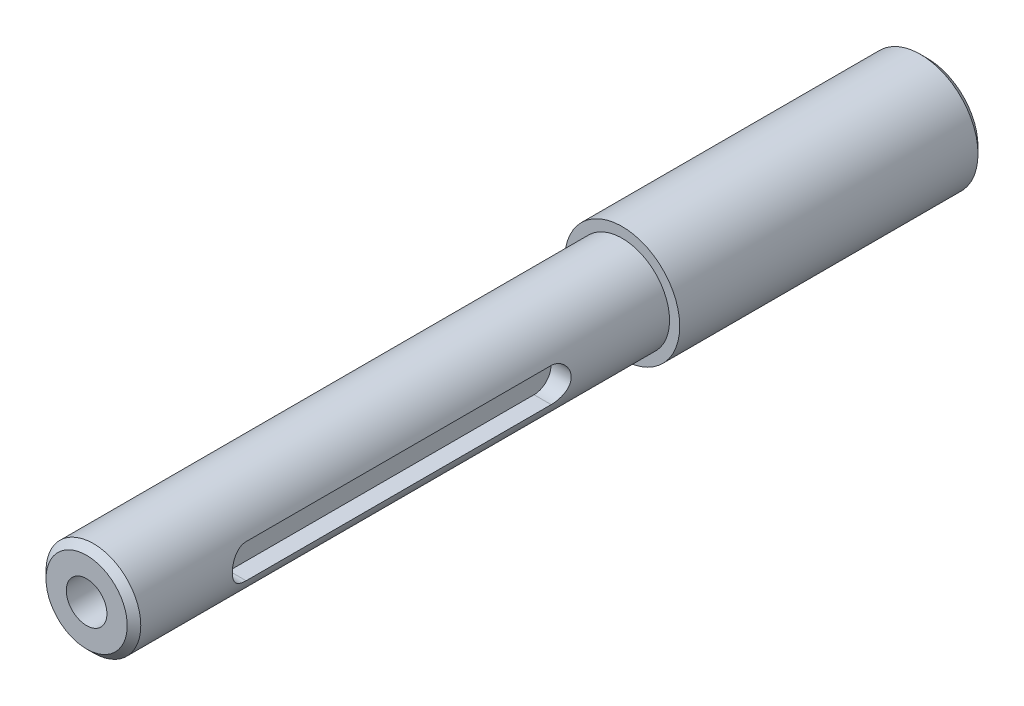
ISO-10303-21;
HEADER;
FILE_DESCRIPTION(('STEP AP214'),'2;1');
FILE_NAME('part.step','',(''),(''),'','','');
FILE_SCHEMA(('AUTOMOTIVE_DESIGN { 1 0 10303 214 1 1 1 1 }'));
ENDSEC;
DATA;
#1=APPLICATION_CONTEXT('core data for automotive mechanical design processes');
#2=APPLICATION_PROTOCOL_DEFINITION('international standard','automotive_design',2000,#1);
#3=PRODUCT_CONTEXT('',#1,'mechanical');
#4=PRODUCT('Part','Part','',(#3));
#5=PRODUCT_RELATED_PRODUCT_CATEGORY('part','',(#4));
#6=PRODUCT_DEFINITION_FORMATION('','',#4);
#7=PRODUCT_DEFINITION_CONTEXT('part definition',#1,'design');
#8=PRODUCT_DEFINITION('design','',#6,#7);
#9=PRODUCT_DEFINITION_SHAPE('','',#8);
#10=(LENGTH_UNIT() NAMED_UNIT(*) SI_UNIT(.MILLI.,.METRE.));
#11=(NAMED_UNIT(*) PLANE_ANGLE_UNIT() SI_UNIT($,.RADIAN.));
#12=(NAMED_UNIT(*) SI_UNIT($,.STERADIAN.) SOLID_ANGLE_UNIT());
#13=UNCERTAINTY_MEASURE_WITH_UNIT(LENGTH_MEASURE(1.E-05),#10,'distance_accuracy_value','');
#14=(GEOMETRIC_REPRESENTATION_CONTEXT(3) GLOBAL_UNCERTAINTY_ASSIGNED_CONTEXT((#13)) GLOBAL_UNIT_ASSIGNED_CONTEXT((#10,
#11,#12)) REPRESENTATION_CONTEXT('',''));
#15=CARTESIAN_POINT('',(0.,0.,0.));
#16=DIRECTION('',(0.,0.,1.));
#17=DIRECTION('',(1.,0.,0.));
#18=AXIS2_PLACEMENT_3D('',#15,#16,#17);
#19=CARTESIAN_POINT('',(0.,0.,0.));
#20=DIRECTION('',(0.,0.,-1.));
#21=DIRECTION('',(-1.,0.,0.));
#22=AXIS2_PLACEMENT_3D('',#19,#20,#21);
#23=PLANE('',#22);
#24=CARTESIAN_POINT('',(0.,0.,-4.48725258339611E-10));
#25=DIRECTION('',(0.,0.,1.));
#26=DIRECTION('',(1.,0.,0.));
#27=AXIS2_PLACEMENT_3D('',#24,#25,#26);
#28=CIRCLE('',#27,7.49000000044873);
#29=CARTESIAN_POINT('',(7.49000000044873,0.,-4.48725258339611E-10));
#30=VERTEX_POINT('',#29);
#31=EDGE_CURVE('E20',#30,#30,#28,.T.);
#32=ORIENTED_EDGE('',*,*,#31,.F.);
#33=EDGE_LOOP('',(#32));
#34=FACE_BOUND('',#33,.T.);
#35=ADVANCED_FACE('F16',(#34),#23,.T.);
#36=CARTESIAN_POINT('',(0.,0.,99.));
#37=DIRECTION('',(0.,0.,1.));
#38=DIRECTION('',(1.,0.,0.));
#39=AXIS2_PLACEMENT_3D('',#36,#37,#38);
#40=CONICAL_SURFACE('',#39,3.,1.02974425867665);
#41=CARTESIAN_POINT('',(0.,0.,97.1974181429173));
#42=VERTEX_POINT('',#41);
#43=VERTEX_LOOP('',#42);
#44=FACE_BOUND('',#43,.T.);
#45=CARTESIAN_POINT('',(0.,0.,99.));
#46=DIRECTION('',(0.,0.,1.));
#47=DIRECTION('',(1.,0.,0.));
#48=AXIS2_PLACEMENT_3D('',#45,#46,#47);
#49=CIRCLE('',#48,3.);
#50=CARTESIAN_POINT('',(3.,0.,99.));
#51=VERTEX_POINT('',#50);
#52=EDGE_CURVE('E69',#51,#51,#49,.T.);
#53=ORIENTED_EDGE('',*,*,#52,.T.);
#54=EDGE_LOOP('',(#53));
#55=FACE_BOUND('',#54,.T.);
#56=ADVANCED_FACE('F63',(#44,#55),#40,.F.);
#57=CARTESIAN_POINT('',(0.,0.,1.00000000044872));
#58=DIRECTION('',(0.,0.,1.));
#59=DIRECTION('',(1.,0.,0.));
#60=AXIS2_PLACEMENT_3D('',#57,#58,#59);
#61=CONICAL_SURFACE('',#60,8.48999999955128,0.785398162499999);
#62=ORIENTED_EDGE('',*,*,#31,.T.);
#63=EDGE_LOOP('',(#62));
#64=FACE_BOUND('',#63,.T.);
#65=CARTESIAN_POINT('',(0.,0.,1.));
#66=DIRECTION('',(0.,0.,1.));
#67=DIRECTION('',(1.,0.,0.));
#68=AXIS2_PLACEMENT_3D('',#65,#66,#67);
#69=CIRCLE('',#68,8.49);
#70=CARTESIAN_POINT('',(8.49,0.,1.));
#71=VERTEX_POINT('',#70);
#72=EDGE_CURVE('E71',#71,#71,#69,.T.);
#73=ORIENTED_EDGE('',*,*,#72,.F.);
#74=EDGE_LOOP('',(#73));
#75=FACE_BOUND('',#74,.T.);
#76=ADVANCED_FACE('F66',(#64,#75),#61,.T.);
#77=CARTESIAN_POINT('',(0.,0.,124.));
#78=DIRECTION('',(0.,0.,-1.));
#79=DIRECTION('',(-1.,0.,0.));
#80=AXIS2_PLACEMENT_3D('',#77,#78,#79);
#81=CYLINDRICAL_SURFACE('',#80,3.);
#82=ORIENTED_EDGE('',*,*,#52,.F.);
#83=EDGE_LOOP('',(#82));
#84=FACE_BOUND('',#83,.T.);
#85=CARTESIAN_POINT('',(0.,0.,124.));
#86=DIRECTION('',(0.,0.,-1.));
#87=DIRECTION('',(-1.,0.,0.));
#88=AXIS2_PLACEMENT_3D('',#85,#86,#87);
#89=CIRCLE('',#88,3.);
#90=CARTESIAN_POINT('',(-3.,0.,124.));
#91=VERTEX_POINT('',#90);
#92=EDGE_CURVE('E74',#91,#91,#89,.F.);
#93=ORIENTED_EDGE('',*,*,#92,.T.);
#94=EDGE_LOOP('',(#93));
#95=FACE_BOUND('',#94,.T.);
#96=ADVANCED_FACE('F18',(#84,#95),#81,.F.);
#97=CARTESIAN_POINT('',(0.,0.,0.));
#98=DIRECTION('',(0.,0.,1.));
#99=DIRECTION('',(1.,0.,0.));
#100=AXIS2_PLACEMENT_3D('',#97,#98,#99);
#101=CYLINDRICAL_SURFACE('',#100,8.49);
#102=ORIENTED_EDGE('',*,*,#72,.T.);
#103=EDGE_LOOP('',(#102));
#104=FACE_BOUND('',#103,.T.);
#105=CARTESIAN_POINT('',(0.,0.,45.));
#106=DIRECTION('',(0.,0.,1.));
#107=DIRECTION('',(1.,0.,0.));
#108=AXIS2_PLACEMENT_3D('',#105,#106,#107);
#109=CIRCLE('',#108,8.49);
#110=CARTESIAN_POINT('',(8.49,0.,45.));
#111=VERTEX_POINT('',#110);
#112=EDGE_CURVE('E132',#111,#111,#109,.F.);
#113=ORIENTED_EDGE('',*,*,#112,.T.);
#114=EDGE_LOOP('',(#113));
#115=FACE_BOUND('',#114,.T.);
#116=ADVANCED_FACE('F150',(#104,#115),#101,.T.);
#117=CARTESIAN_POINT('',(4.,0.,84.5));
#118=DIRECTION('',(1.,0.,0.));
#119=DIRECTION('',(0.,0.,-1.));
#120=AXIS2_PLACEMENT_3D('',#117,#118,#119);
#121=PLANE('',#120);
#122=CARTESIAN_POINT('',(4.,0.,62.));
#123=DIRECTION('',(1.,0.,0.));
#124=DIRECTION('',(0.,0.,-1.));
#125=AXIS2_PLACEMENT_3D('',#122,#123,#124);
#126=CIRCLE('',#125,2.5);
#127=CARTESIAN_POINT('',(4.,-2.5,62.));
#128=VERTEX_POINT('',#127);
#129=CARTESIAN_POINT('',(4.,2.5,62.));
#130=VERTEX_POINT('',#129);
#131=EDGE_CURVE('E59',#128,#130,#126,.T.);
#132=ORIENTED_EDGE('',*,*,#131,.T.);
#133=DIRECTION('',(0.,0.,1.));
#134=VECTOR('',#133,1.);
#135=CARTESIAN_POINT('',(4.,2.5,107.));
#136=LINE('',#135,#134);
#137=CARTESIAN_POINT('',(4.,2.5,107.));
#138=VERTEX_POINT('',#137);
#139=EDGE_CURVE('E131',#130,#138,#136,.T.);
#140=ORIENTED_EDGE('',*,*,#139,.T.);
#141=CARTESIAN_POINT('',(4.,0.,107.));
#142=DIRECTION('',(1.,0.,0.));
#143=DIRECTION('',(0.,0.,-1.));
#144=AXIS2_PLACEMENT_3D('',#141,#142,#143);
#145=CIRCLE('',#144,2.5);
#146=CARTESIAN_POINT('',(4.,-2.5,107.));
#147=VERTEX_POINT('',#146);
#148=EDGE_CURVE('E124',#138,#147,#145,.T.);
#149=ORIENTED_EDGE('',*,*,#148,.T.);
#150=DIRECTION('',(0.,0.,-1.));
#151=VECTOR('',#150,1.);
#152=CARTESIAN_POINT('',(4.,-2.5,62.));
#153=LINE('',#152,#151);
#154=EDGE_CURVE('E57',#147,#128,#153,.T.);
#155=ORIENTED_EDGE('',*,*,#154,.T.);
#156=EDGE_LOOP('',(#132,#140,#149,#155));
#157=FACE_BOUND('',#156,.T.);
#158=ADVANCED_FACE('F141',(#157),#121,.T.);
#159=CARTESIAN_POINT('',(0.,0.,124.));
#160=DIRECTION('',(0.,0.,-1.));
#161=DIRECTION('',(-1.,0.,0.));
#162=AXIS2_PLACEMENT_3D('',#159,#160,#161);
#163=PLANE('',#162);
#164=ORIENTED_EDGE('',*,*,#92,.F.);
#165=EDGE_LOOP('',(#164));
#166=FACE_BOUND('',#165,.T.);
#167=CARTESIAN_POINT('',(0.,0.,124.000000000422));
#168=DIRECTION('',(0.,0.,-1.));
#169=DIRECTION('',(-1.,0.,0.));
#170=AXIS2_PLACEMENT_3D('',#167,#168,#169);
#171=CIRCLE('',#170,5.9900000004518);
#172=CARTESIAN_POINT('',(-5.9900000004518,0.,124.000000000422));
#173=VERTEX_POINT('',#172);
#174=EDGE_CURVE('E118',#173,#173,#171,.T.);
#175=ORIENTED_EDGE('',*,*,#174,.F.);
#176=EDGE_LOOP('',(#175));
#177=FACE_BOUND('',#176,.T.);
#178=ADVANCED_FACE('F138',(#166,#177),#163,.F.);
#179=CARTESIAN_POINT('',(0.,0.,45.));
#180=DIRECTION('',(0.,0.,-1.));
#181=DIRECTION('',(-1.,0.,0.));
#182=AXIS2_PLACEMENT_3D('',#179,#180,#181);
#183=PLANE('',#182);
#184=CARTESIAN_POINT('',(0.,0.,45.));
#185=DIRECTION('',(0.,0.,1.));
#186=DIRECTION('',(1.,0.,0.));
#187=AXIS2_PLACEMENT_3D('',#184,#185,#186);
#188=CIRCLE('',#187,6.99);
#189=CARTESIAN_POINT('',(6.99,0.,45.));
#190=VERTEX_POINT('',#189);
#191=EDGE_CURVE('E120',#190,#190,#188,.T.);
#192=ORIENTED_EDGE('',*,*,#191,.F.);
#193=EDGE_LOOP('',(#192));
#194=FACE_BOUND('',#193,.T.);
#195=ORIENTED_EDGE('',*,*,#112,.F.);
#196=EDGE_LOOP('',(#195));
#197=FACE_BOUND('',#196,.T.);
#198=ADVANCED_FACE('F140',(#194,#197),#183,.F.);
#199=CARTESIAN_POINT('',(4.,2.5,107.));
#200=DIRECTION('',(0.,1.,0.));
#201=DIRECTION('',(0.,0.,1.));
#202=AXIS2_PLACEMENT_3D('',#199,#200,#201);
#203=PLANE('',#202);
#204=DIRECTION('',(1.,0.,0.));
#205=VECTOR('',#204,1.);
#206=CARTESIAN_POINT('',(4.,2.5,107.));
#207=LINE('',#206,#205);
#208=CARTESIAN_POINT('',(6.52764122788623,2.5,107.));
#209=VERTEX_POINT('',#208);
#210=EDGE_CURVE('E128',#209,#138,#207,.F.);
#211=ORIENTED_EDGE('',*,*,#210,.T.);
#212=ORIENTED_EDGE('',*,*,#139,.F.);
#213=DIRECTION('',(1.,0.,0.));
#214=VECTOR('',#213,1.);
#215=CARTESIAN_POINT('',(4.,2.5,62.));
#216=LINE('',#215,#214);
#217=CARTESIAN_POINT('',(6.52764122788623,2.5,62.));
#218=VERTEX_POINT('',#217);
#219=EDGE_CURVE('E130',#130,#218,#216,.T.);
#220=ORIENTED_EDGE('',*,*,#219,.T.);
#221=DIRECTION('',(0.,0.,1.));
#222=VECTOR('',#221,1.);
#223=CARTESIAN_POINT('',(6.52764122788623,2.5,45.));
#224=LINE('',#223,#222);
#225=EDGE_CURVE('E123',#209,#218,#224,.F.);
#226=ORIENTED_EDGE('',*,*,#225,.F.);
#227=EDGE_LOOP('',(#211,#212,#220,#226));
#228=FACE_BOUND('',#227,.T.);
#229=ADVANCED_FACE('F147',(#228),#203,.F.);
#230=CARTESIAN_POINT('',(4.,0.,62.));
#231=DIRECTION('',(1.,0.,0.));
#232=DIRECTION('',(0.,0.,-1.));
#233=AXIS2_PLACEMENT_3D('',#230,#231,#232);
#234=CYLINDRICAL_SURFACE('',#233,2.5);
#235=ORIENTED_EDGE('',*,*,#219,.F.);
#236=ORIENTED_EDGE('',*,*,#131,.F.);
#237=DIRECTION('',(1.,0.,0.));
#238=VECTOR('',#237,1.);
#239=CARTESIAN_POINT('',(4.,-2.5,62.));
#240=LINE('',#239,#238);
#241=CARTESIAN_POINT('',(6.52764122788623,-2.5,62.));
#242=VERTEX_POINT('',#241);
#243=EDGE_CURVE('E234',#128,#242,#240,.T.);
#244=ORIENTED_EDGE('',*,*,#243,.T.);
#245=CARTESIAN_POINT('',(6.52764122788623,2.5,62.));
#246=CARTESIAN_POINT('',(6.52762932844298,2.50000932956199,61.9321178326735));
#247=CARTESIAN_POINT('',(6.52869982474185,2.49723542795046,61.8642422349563));
#248=CARTESIAN_POINT('',(6.53291691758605,2.48619392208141,61.7290245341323));
#249=CARTESIAN_POINT('',(6.53606287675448,2.47792800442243,61.6616822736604));
#250=CARTESIAN_POINT('',(6.54432869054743,2.45601124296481,61.5282291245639));
#251=CARTESIAN_POINT('',(6.54944201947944,2.44237819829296,61.4621149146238));
#252=CARTESIAN_POINT('',(6.56147229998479,2.40987135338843,61.3313718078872));
#253=CARTESIAN_POINT('',(6.5683893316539,2.39099732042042,61.2667429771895));
#254=CARTESIAN_POINT('',(6.59153147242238,2.3267801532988,61.0758402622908));
#255=CARTESIAN_POINT('',(6.61016236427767,2.27380524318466,60.9523295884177));
#256=CARTESIAN_POINT('',(6.65171798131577,2.14919483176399,60.7159177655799));
#257=CARTESIAN_POINT('',(6.67464584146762,2.07754569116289,60.6030244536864));
#258=CARTESIAN_POINT('',(6.72336274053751,1.91416778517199,60.3859538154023));
#259=CARTESIAN_POINT('',(6.74923032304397,1.82173941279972,60.2823195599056));
#260=CARTESIAN_POINT('',(6.80025349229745,1.62091775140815,60.0916479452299));
#261=CARTESIAN_POINT('',(6.82540894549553,1.51252149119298,60.0046136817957));
#262=CARTESIAN_POINT('',(6.87310216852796,1.27875147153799,59.8470357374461));
#263=CARTESIAN_POINT('',(6.89553639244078,1.15295997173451,59.7770775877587));
#264=CARTESIAN_POINT('',(6.93431732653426,0.890455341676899,59.6595405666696));
#265=CARTESIAN_POINT('',(6.95066612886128,0.753745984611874,59.6119540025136));
#266=CARTESIAN_POINT('',(6.97487541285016,0.479024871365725,59.5423975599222));
#267=CARTESIAN_POINT('',(6.98304624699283,0.341278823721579,59.5194883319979));
#268=CARTESIAN_POINT('',(6.99108762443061,0.0636687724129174,59.4969369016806));
#269=CARTESIAN_POINT('',(6.99096047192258,-0.0761946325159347,59.4972882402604));
#270=CARTESIAN_POINT('',(6.98262286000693,-0.347368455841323,59.5206807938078));
#271=CARTESIAN_POINT('',(6.97477696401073,-0.478780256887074,59.5426986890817));
#272=CARTESIAN_POINT('',(6.95235298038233,-0.735901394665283,59.6070901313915));
#273=CARTESIAN_POINT('',(6.93777451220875,-0.861610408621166,59.6494648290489));
#274=CARTESIAN_POINT('',(6.90308940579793,-1.10584718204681,59.7538935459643));
#275=CARTESIAN_POINT('',(6.88290798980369,-1.22424926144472,59.816215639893));
#276=CARTESIAN_POINT('',(6.83908468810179,-1.44919738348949,59.9585408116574));
#277=CARTESIAN_POINT('',(6.81544174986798,-1.55573980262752,60.0385492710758));
#278=CARTESIAN_POINT('',(6.76566074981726,-1.75999327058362,60.2189963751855));
#279=CARTESIAN_POINT('',(6.73945687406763,-1.85692513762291,60.3203000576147));
#280=CARTESIAN_POINT('',(6.68853967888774,-2.0327160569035,60.5379342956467));
#281=CARTESIAN_POINT('',(6.6638268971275,-2.11156861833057,60.6542702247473));
#282=CARTESIAN_POINT('',(6.61829017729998,-2.25028518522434,60.9015041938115));
#283=CARTESIAN_POINT('',(6.5975494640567,-2.30975805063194,61.0326377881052));
#284=CARTESIAN_POINT('',(6.56327947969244,-2.40542819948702,61.3039263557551));
#285=CARTESIAN_POINT('',(6.54973844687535,-2.44166346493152,61.4440661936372));
#286=CARTESIAN_POINT('',(6.53641062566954,-2.47700740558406,61.6546749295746));
#287=CARTESIAN_POINT('',(6.53313324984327,-2.4856236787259,61.7234505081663));
#288=CARTESIAN_POINT('',(6.52874601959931,-2.49711753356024,61.8614711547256));
#289=CARTESIAN_POINT('',(6.52763377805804,-2.50000143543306,61.9307156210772));
#290=CARTESIAN_POINT('',(6.52764122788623,-2.5,62.));
#291=B_SPLINE_CURVE_WITH_KNOTS('',3,(#245,#246,#247,#248,#249,#250,#251,#252,#253,#254,#255,
#256,#257,#258,#259,#260,#261,#262,#263,#264,#265,#266,#267,#268,#269,#270,#271,#272,#273,#274,
#275,#276,#277,#278,#279,#280,#281,#282,#283,#284,#285,#286,#287,#288,#289,#290),.UNSPECIFIED.,
.F.,.F.,(4,2,2,2,2,2,2,2,2,2,2,2,2,2,2,2,2,2,2,2,2,2,4),(0.,0.203570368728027,0.407078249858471,
0.609916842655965,0.812764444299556,1.21779583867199,1.62312389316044,2.04497874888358,
2.46691219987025,2.90174567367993,3.33642951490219,3.75390878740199,4.17127213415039,
4.5698254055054,4.96840120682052,5.37257581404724,5.77687357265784,6.2028362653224,
6.62895164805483,7.06319987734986,7.49673650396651,7.7046723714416,7.91237885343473),.UNSPECIFIED.);
#292=EDGE_CURVE('E90',#218,#242,#291,.T.);
#293=ORIENTED_EDGE('',*,*,#292,.F.);
#294=EDGE_LOOP('',(#235,#236,#244,#293));
#295=FACE_BOUND('',#294,.T.);
#296=ADVANCED_FACE('F209',(#295),#234,.F.);
#297=CARTESIAN_POINT('',(4.,-2.5,62.));
#298=DIRECTION('',(0.,-1.,0.));
#299=DIRECTION('',(0.,0.,-1.));
#300=AXIS2_PLACEMENT_3D('',#297,#298,#299);
#301=PLANE('',#300);
#302=ORIENTED_EDGE('',*,*,#243,.F.);
#303=ORIENTED_EDGE('',*,*,#154,.F.);
#304=DIRECTION('',(1.,0.,0.));
#305=VECTOR('',#304,1.);
#306=CARTESIAN_POINT('',(4.,-2.5,107.));
#307=LINE('',#306,#305);
#308=CARTESIAN_POINT('',(6.52764122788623,-2.5,107.));
#309=VERTEX_POINT('',#308);
#310=EDGE_CURVE('E35',#147,#309,#307,.T.);
#311=ORIENTED_EDGE('',*,*,#310,.T.);
#312=DIRECTION('',(0.,0.,1.));
#313=VECTOR('',#312,1.);
#314=CARTESIAN_POINT('',(6.52764122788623,-2.5,45.));
#315=LINE('',#314,#313);
#316=EDGE_CURVE('E89',#242,#309,#315,.T.);
#317=ORIENTED_EDGE('',*,*,#316,.F.);
#318=EDGE_LOOP('',(#302,#303,#311,#317));
#319=FACE_BOUND('',#318,.T.);
#320=ADVANCED_FACE('F112',(#319),#301,.F.);
#321=CARTESIAN_POINT('',(4.,0.,107.));
#322=DIRECTION('',(1.,0.,0.));
#323=DIRECTION('',(0.,0.,-1.));
#324=AXIS2_PLACEMENT_3D('',#321,#322,#323);
#325=CYLINDRICAL_SURFACE('',#324,2.5);
#326=ORIENTED_EDGE('',*,*,#310,.F.);
#327=ORIENTED_EDGE('',*,*,#148,.F.);
#328=ORIENTED_EDGE('',*,*,#210,.F.);
#329=CARTESIAN_POINT('',(6.52764122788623,-2.5,107.));
#330=CARTESIAN_POINT('',(6.52762932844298,-2.50000932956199,107.067882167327));
#331=CARTESIAN_POINT('',(6.52869982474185,-2.49723542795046,107.135757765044));
#332=CARTESIAN_POINT('',(6.53291691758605,-2.48619392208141,107.270975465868));
#333=CARTESIAN_POINT('',(6.53606287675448,-2.47792800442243,107.33831772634));
#334=CARTESIAN_POINT('',(6.54432869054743,-2.45601124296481,107.471770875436));
#335=CARTESIAN_POINT('',(6.54944201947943,-2.44237819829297,107.537885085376));
#336=CARTESIAN_POINT('',(6.56147229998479,-2.40987135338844,107.668628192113));
#337=CARTESIAN_POINT('',(6.5683893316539,-2.39099732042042,107.73325702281));
#338=CARTESIAN_POINT('',(6.59153147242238,-2.3267801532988,107.924159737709));
#339=CARTESIAN_POINT('',(6.61016236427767,-2.27380524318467,108.047670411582));
#340=CARTESIAN_POINT('',(6.65171798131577,-2.149194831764,108.28408223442));
#341=CARTESIAN_POINT('',(6.67464584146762,-2.0775456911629,108.396975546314));
#342=CARTESIAN_POINT('',(6.72336274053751,-1.91416778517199,108.614046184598));
#343=CARTESIAN_POINT('',(6.74923032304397,-1.82173941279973,108.717680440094));
#344=CARTESIAN_POINT('',(6.80025349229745,-1.62091775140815,108.90835205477));
#345=CARTESIAN_POINT('',(6.82540894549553,-1.51252149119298,108.995386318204));
#346=CARTESIAN_POINT('',(6.87310216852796,-1.278751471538,109.152964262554));
#347=CARTESIAN_POINT('',(6.89553639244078,-1.15295997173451,109.222922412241));
#348=CARTESIAN_POINT('',(6.93431732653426,-0.890455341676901,109.34045943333));
#349=CARTESIAN_POINT('',(6.95066612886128,-0.753745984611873,109.388045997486));
#350=CARTESIAN_POINT('',(6.97487541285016,-0.479024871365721,109.457602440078));
#351=CARTESIAN_POINT('',(6.98304624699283,-0.341278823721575,109.480511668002));
#352=CARTESIAN_POINT('',(6.99108762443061,-0.0636687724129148,109.503063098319));
#353=CARTESIAN_POINT('',(6.99096047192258,0.0761946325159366,109.50271175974));
#354=CARTESIAN_POINT('',(6.98262286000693,0.347368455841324,109.479319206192));
#355=CARTESIAN_POINT('',(6.97477696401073,0.478780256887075,109.457301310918));
#356=CARTESIAN_POINT('',(6.95235298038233,0.735901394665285,109.392909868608));
#357=CARTESIAN_POINT('',(6.93777451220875,0.861610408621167,109.350535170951));
#358=CARTESIAN_POINT('',(6.90308940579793,1.10584718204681,109.246106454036));
#359=CARTESIAN_POINT('',(6.88290798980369,1.22424926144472,109.183784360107));
#360=CARTESIAN_POINT('',(6.83908468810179,1.44919738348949,109.041459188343));
#361=CARTESIAN_POINT('',(6.81544174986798,1.55573980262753,108.961450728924));
#362=CARTESIAN_POINT('',(6.76566074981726,1.75999327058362,108.781003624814));
#363=CARTESIAN_POINT('',(6.73945687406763,1.85692513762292,108.679699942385));
#364=CARTESIAN_POINT('',(6.68853967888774,2.0327160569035,108.462065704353));
#365=CARTESIAN_POINT('',(6.66382689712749,2.11156861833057,108.345729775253));
#366=CARTESIAN_POINT('',(6.61829017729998,2.25028518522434,108.098495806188));
#367=CARTESIAN_POINT('',(6.5975494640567,2.30975805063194,107.967362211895));
#368=CARTESIAN_POINT('',(6.56327947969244,2.40542819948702,107.696073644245));
#369=CARTESIAN_POINT('',(6.54973844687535,2.44166346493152,107.555933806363));
#370=CARTESIAN_POINT('',(6.53641062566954,2.47700740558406,107.345325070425));
#371=CARTESIAN_POINT('',(6.53313324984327,2.4856236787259,107.276549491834));
#372=CARTESIAN_POINT('',(6.52874601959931,2.49711753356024,107.138528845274));
#373=CARTESIAN_POINT('',(6.52763377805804,2.50000143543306,107.069284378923));
#374=CARTESIAN_POINT('',(6.52764122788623,2.5,107.));
#375=B_SPLINE_CURVE_WITH_KNOTS('',3,(#329,#330,#331,#332,#333,#334,#335,#336,#337,#338,#339,
#340,#341,#342,#343,#344,#345,#346,#347,#348,#349,#350,#351,#352,#353,#354,#355,#356,#357,#358,
#359,#360,#361,#362,#363,#364,#365,#366,#367,#368,#369,#370,#371,#372,#373,#374),.UNSPECIFIED.,
.F.,.F.,(4,2,2,2,2,2,2,2,2,2,2,2,2,2,2,2,2,2,2,2,2,2,4),(0.,0.20357036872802,0.407078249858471,
0.609916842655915,0.812764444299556,1.21779583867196,1.62312389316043,2.04497874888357,
2.46691219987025,2.90174567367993,3.3364295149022,3.75390878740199,4.17127213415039,
4.5698254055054,4.96840120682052,5.37257581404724,5.77687357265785,6.20283626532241,
6.62895164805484,7.06319987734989,7.4967365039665,7.70467237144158,7.91237885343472),.UNSPECIFIED.);
#376=EDGE_CURVE('E26',#309,#209,#375,.T.);
#377=ORIENTED_EDGE('',*,*,#376,.F.);
#378=EDGE_LOOP('',(#326,#327,#328,#377));
#379=FACE_BOUND('',#378,.T.);
#380=ADVANCED_FACE('F96',(#379),#325,.F.);
#381=CARTESIAN_POINT('',(0.,0.,122.999999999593));
#382=DIRECTION('',(0.,0.,-1.));
#383=DIRECTION('',(-1.,0.,0.));
#384=AXIS2_PLACEMENT_3D('',#381,#382,#383);
#385=CONICAL_SURFACE('',#384,6.98999999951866,0.785398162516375);
#386=CARTESIAN_POINT('',(0.,0.,123.));
#387=DIRECTION('',(0.,0.,1.));
#388=DIRECTION('',(1.,0.,0.));
#389=AXIS2_PLACEMENT_3D('',#386,#387,#388);
#390=CIRCLE('',#389,6.99);
#391=CARTESIAN_POINT('',(6.99,0.,123.));
#392=VERTEX_POINT('',#391);
#393=EDGE_CURVE('E11',#392,#392,#390,.F.);
#394=ORIENTED_EDGE('',*,*,#393,.F.);
#395=EDGE_LOOP('',(#394));
#396=FACE_BOUND('',#395,.T.);
#397=ORIENTED_EDGE('',*,*,#174,.T.);
#398=EDGE_LOOP('',(#397));
#399=FACE_BOUND('',#398,.T.);
#400=ADVANCED_FACE('F103',(#396,#399),#385,.T.);
#401=CARTESIAN_POINT('',(0.,0.,45.));
#402=DIRECTION('',(0.,0.,1.));
#403=DIRECTION('',(1.,0.,0.));
#404=AXIS2_PLACEMENT_3D('',#401,#402,#403);
#405=CYLINDRICAL_SURFACE('',#404,6.99);
#406=ORIENTED_EDGE('',*,*,#393,.T.);
#407=EDGE_LOOP('',(#406));
#408=FACE_BOUND('',#407,.T.);
#409=ORIENTED_EDGE('',*,*,#316,.T.);
#410=ORIENTED_EDGE('',*,*,#376,.T.);
#411=ORIENTED_EDGE('',*,*,#225,.T.);
#412=ORIENTED_EDGE('',*,*,#292,.T.);
#413=EDGE_LOOP('',(#409,#410,#411,#412));
#414=FACE_BOUND('',#413,.T.);
#415=ORIENTED_EDGE('',*,*,#191,.T.);
#416=EDGE_LOOP('',(#415));
#417=FACE_BOUND('',#416,.T.);
#418=ADVANCED_FACE('F100',(#408,#414,#417),#405,.T.);
#419=CLOSED_SHELL('',(#35,#56,#76,#96,#116,#158,#178,#198,#229,#296,#320,#380,#400,#418));
#420=MANIFOLD_SOLID_BREP('B1',#419);
#421=ADVANCED_BREP_SHAPE_REPRESENTATION('',(#18,#420),#14);
#422=SHAPE_DEFINITION_REPRESENTATION(#9,#421);
ENDSEC;
END-ISO-10303-21;
